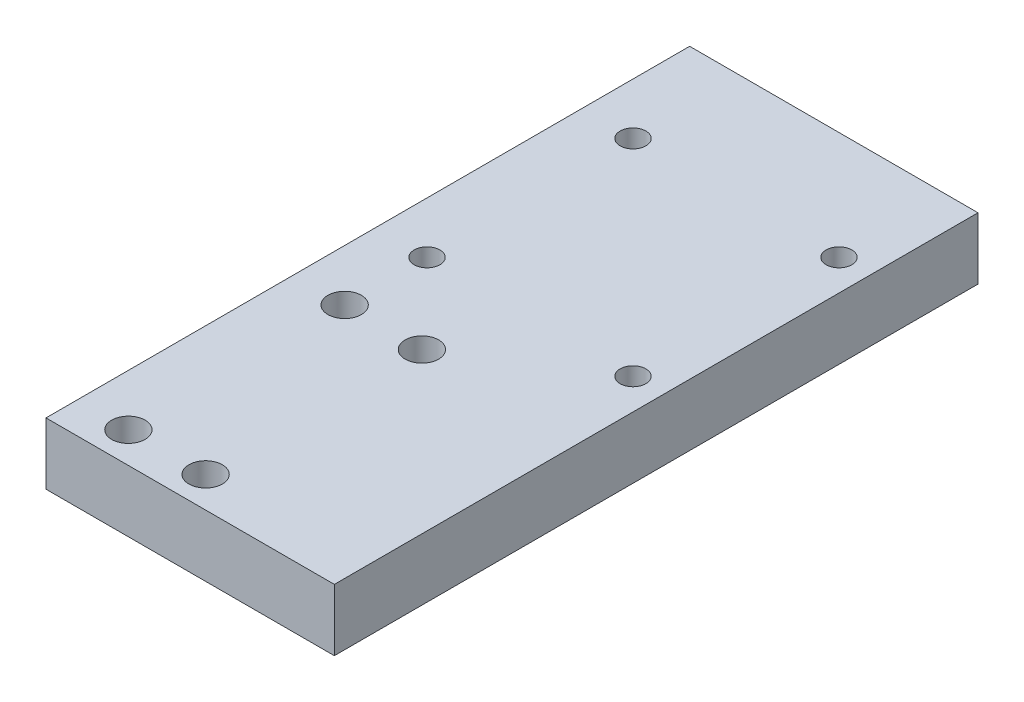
from build123d import *

# Parameters (mm, degrees)
SKETCH_1_W          = 56
SKETCH_1_H          = 12
EXTRUDE_1_DEPTH     = 125
SKETCH_2_R          = 3.25
SKETCH_2_R_2        = 2.5
CUT_EXTRUDE_1_DEPTH = 125
SKETCH_4_R          = 5.5
CUT_EXTRUDE_2_DEPTH = 6.5
SKETCH_6_R          = 2.1
CUT_EXTRUDE_3_DEPTH = 15


with BuildPart() as part:
    # Sketch 1 → Extrude 1 (new body)
    with BuildSketch(Plane.XY):
        with Locations((28, 6)):
            Rectangle(SKETCH_1_W, SKETCH_1_H)
    extrude(amount=EXTRUDE_1_DEPTH)

    # Sketch 2 → Cut-Extrude 1 (cut)
    with BuildSketch(Plane(origin=(0, 12, 0), x_dir=(1, 0, 0), z_dir=(0, 1, 0))):
        with Locations(Location((10, -77, 0), (0, 0, 180))):
            Circle(SKETCH_2_R)
        with Locations(Location((10, -119, 0), (0, 0, 180))):
            Circle(SKETCH_2_R)
        with Locations(Location((25, -119, 0), (0, 0, 180))):
            Circle(SKETCH_2_R)
        with Locations(Location((25, -77, 0), (0, 0, 180))):
            Circle(SKETCH_2_R)
        with Locations(Location((10, -21, 0), (0, 0, 180))):
            Circle(SKETCH_2_R_2)
        with Locations(Location((50, -21, 0), (0, 0, 180))):
            Circle(SKETCH_2_R_2)
        with Locations(Location((50, -61, 0), (0, 0, 180))):
            Circle(SKETCH_2_R_2)
        with Locations(Location((10, -61, 0), (0, 0, 180))):
            Circle(SKETCH_2_R_2)
    extrude(amount=-CUT_EXTRUDE_1_DEPTH, mode=Mode.SUBTRACT)

    # Sketch 4 → Cut-Extrude 2 (cut)
    with BuildSketch(Plane.XZ):
        with Locations((10, 119)):
            Circle(SKETCH_4_R)
        with Locations((25, 119)):
            Circle(SKETCH_4_R)
        with Locations((25, 77)):
            Circle(SKETCH_4_R)
        with Locations((10, 77)):
            Circle(SKETCH_4_R)
    extrude(amount=-CUT_EXTRUDE_2_DEPTH, mode=Mode.SUBTRACT)

    # Sketch 6 → Cut-Extrude 3 (cut)
    with BuildSketch(Plane(origin=(0, 0, 0), x_dir=(-1, 0, 0), z_dir=(0, 0, -1))):
        with Locations((-24, 6)):
            Circle(SKETCH_6_R)
        with Locations((-6, 6)):
            Circle(SKETCH_6_R)
    extrude(amount=-CUT_EXTRUDE_3_DEPTH, mode=Mode.SUBTRACT)


solid = part.part
